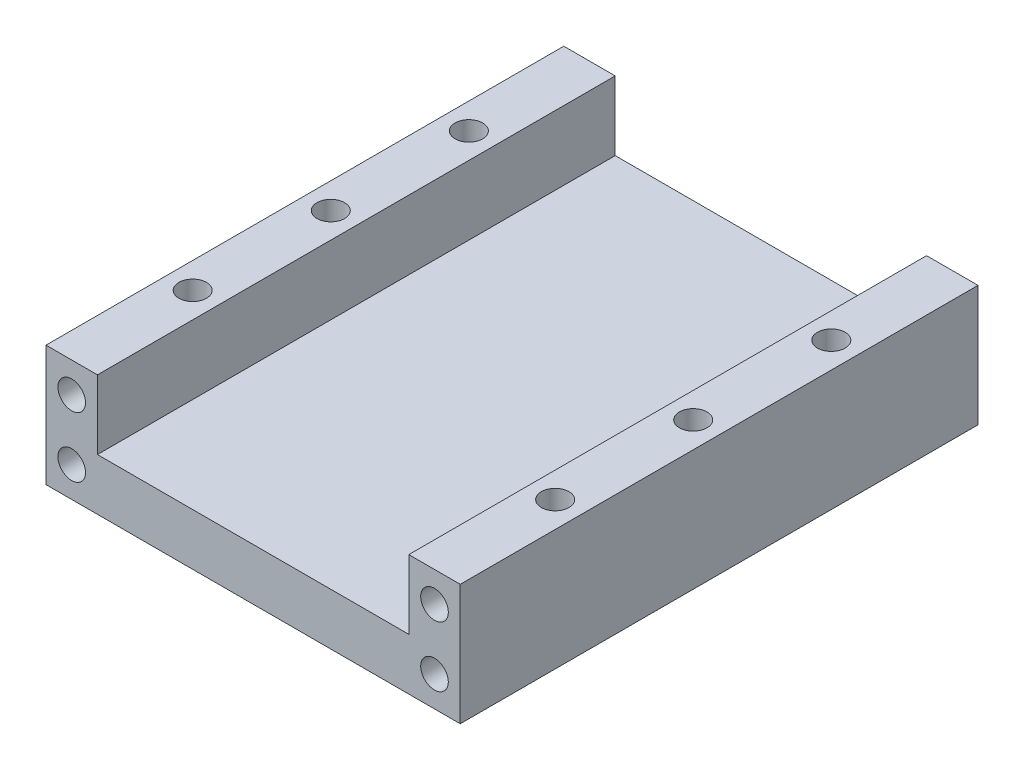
ISO-10303-21;
HEADER;
FILE_DESCRIPTION(('STEP AP214'),'2;1');
FILE_NAME('part.step','',(''),(''),'','','');
FILE_SCHEMA(('AUTOMOTIVE_DESIGN { 1 0 10303 214 1 1 1 1 }'));
ENDSEC;
DATA;
#1=APPLICATION_CONTEXT('core data for automotive mechanical design processes');
#2=APPLICATION_PROTOCOL_DEFINITION('international standard','automotive_design',2000,#1);
#3=PRODUCT_CONTEXT('',#1,'mechanical');
#4=PRODUCT('Part','Part','',(#3));
#5=PRODUCT_RELATED_PRODUCT_CATEGORY('part','',(#4));
#6=PRODUCT_DEFINITION_FORMATION('','',#4);
#7=PRODUCT_DEFINITION_CONTEXT('part definition',#1,'design');
#8=PRODUCT_DEFINITION('design','',#6,#7);
#9=PRODUCT_DEFINITION_SHAPE('','',#8);
#10=(LENGTH_UNIT() NAMED_UNIT(*) SI_UNIT(.MILLI.,.METRE.));
#11=(NAMED_UNIT(*) PLANE_ANGLE_UNIT() SI_UNIT($,.RADIAN.));
#12=(NAMED_UNIT(*) SI_UNIT($,.STERADIAN.) SOLID_ANGLE_UNIT());
#13=UNCERTAINTY_MEASURE_WITH_UNIT(LENGTH_MEASURE(1.E-05),#10,'distance_accuracy_value','');
#14=(GEOMETRIC_REPRESENTATION_CONTEXT(3) GLOBAL_UNCERTAINTY_ASSIGNED_CONTEXT((#13)) GLOBAL_UNIT_ASSIGNED_CONTEXT((#10,
#11,#12)) REPRESENTATION_CONTEXT('',''));
#15=CARTESIAN_POINT('',(0.,0.,0.));
#16=DIRECTION('',(0.,0.,1.));
#17=DIRECTION('',(1.,0.,0.));
#18=AXIS2_PLACEMENT_3D('',#15,#16,#17);
#19=CARTESIAN_POINT('',(60.,14.0579710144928,150.));
#20=DIRECTION('',(-1.,0.,0.));
#21=DIRECTION('',(0.,-1.,0.));
#22=AXIS2_PLACEMENT_3D('',#19,#20,#21);
#23=PLANE('',#22);
#24=DIRECTION('',(0.,1.,0.));
#25=VECTOR('',#24,1.);
#26=CARTESIAN_POINT('',(60.,14.0579710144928,0.));
#27=LINE('',#26,#25);
#28=CARTESIAN_POINT('',(60.,0.,0.));
#29=VERTEX_POINT('',#28);
#30=CARTESIAN_POINT('',(60.,35.,0.));
#31=VERTEX_POINT('',#30);
#32=EDGE_CURVE('E245',#29,#31,#27,.T.);
#33=ORIENTED_EDGE('',*,*,#32,.T.);
#34=DIRECTION('',(0.,0.,-1.));
#35=VECTOR('',#34,1.);
#36=CARTESIAN_POINT('',(60.,35.,150.));
#37=LINE('',#36,#35);
#38=CARTESIAN_POINT('',(60.,35.,150.));
#39=VERTEX_POINT('',#38);
#40=EDGE_CURVE('E280',#39,#31,#37,.T.);
#41=ORIENTED_EDGE('',*,*,#40,.F.);
#42=DIRECTION('',(0.,1.,0.));
#43=VECTOR('',#42,1.);
#44=CARTESIAN_POINT('',(60.,0.,150.));
#45=LINE('',#44,#43);
#46=CARTESIAN_POINT('',(60.,0.,150.));
#47=VERTEX_POINT('',#46);
#48=EDGE_CURVE('E246',#47,#39,#45,.T.);
#49=ORIENTED_EDGE('',*,*,#48,.F.);
#50=DIRECTION('',(0.,0.,-1.));
#51=VECTOR('',#50,1.);
#52=CARTESIAN_POINT('',(60.,0.,150.));
#53=LINE('',#52,#51);
#54=EDGE_CURVE('E260',#47,#29,#53,.T.);
#55=ORIENTED_EDGE('',*,*,#54,.T.);
#56=EDGE_LOOP('',(#33,#41,#49,#55));
#57=FACE_BOUND('',#56,.T.);
#58=ADVANCED_FACE('F34',(#57),#23,.F.);
#59=CARTESIAN_POINT('',(60.,35.,150.));
#60=DIRECTION('',(0.,-1.,0.));
#61=DIRECTION('',(0.,0.,-1.));
#62=AXIS2_PLACEMENT_3D('',#59,#60,#61);
#63=PLANE('',#62);
#64=CARTESIAN_POINT('',(52.5,35.,115.));
#65=DIRECTION('',(0.,1.,0.));
#66=DIRECTION('',(0.,0.,1.));
#67=AXIS2_PLACEMENT_3D('',#64,#65,#66);
#68=CIRCLE('',#67,3.99999999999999);
#69=CARTESIAN_POINT('',(52.5,35.,119.));
#70=VERTEX_POINT('',#69);
#71=EDGE_CURVE('E227',#70,#70,#68,.T.);
#72=ORIENTED_EDGE('',*,*,#71,.F.);
#73=EDGE_LOOP('',(#72));
#74=FACE_BOUND('',#73,.T.);
#75=CARTESIAN_POINT('',(52.5,35.,75.));
#76=DIRECTION('',(0.,1.,0.));
#77=DIRECTION('',(0.,0.,1.));
#78=AXIS2_PLACEMENT_3D('',#75,#76,#77);
#79=CIRCLE('',#78,3.99999999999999);
#80=CARTESIAN_POINT('',(52.5,35.,79.));
#81=VERTEX_POINT('',#80);
#82=EDGE_CURVE('E233',#81,#81,#79,.T.);
#83=ORIENTED_EDGE('',*,*,#82,.F.);
#84=EDGE_LOOP('',(#83));
#85=FACE_BOUND('',#84,.T.);
#86=CARTESIAN_POINT('',(52.5,35.,35.));
#87=DIRECTION('',(0.,1.,0.));
#88=DIRECTION('',(0.,0.,1.));
#89=AXIS2_PLACEMENT_3D('',#86,#87,#88);
#90=CIRCLE('',#89,3.99999999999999);
#91=CARTESIAN_POINT('',(52.5,35.,39.));
#92=VERTEX_POINT('',#91);
#93=EDGE_CURVE('E239',#92,#92,#90,.T.);
#94=ORIENTED_EDGE('',*,*,#93,.F.);
#95=EDGE_LOOP('',(#94));
#96=FACE_BOUND('',#95,.T.);
#97=DIRECTION('',(-1.,0.,0.));
#98=VECTOR('',#97,1.);
#99=CARTESIAN_POINT('',(60.,35.,0.));
#100=LINE('',#99,#98);
#101=CARTESIAN_POINT('',(45.1,35.,0.));
#102=VERTEX_POINT('',#101);
#103=EDGE_CURVE('E262',#31,#102,#100,.T.);
#104=ORIENTED_EDGE('',*,*,#103,.T.);
#105=DIRECTION('',(0.,0.,1.));
#106=VECTOR('',#105,1.);
#107=CARTESIAN_POINT('',(45.1,35.,-14.));
#108=LINE('',#107,#106);
#109=CARTESIAN_POINT('',(45.1,35.,150.));
#110=VERTEX_POINT('',#109);
#111=EDGE_CURVE('E204',#102,#110,#108,.T.);
#112=ORIENTED_EDGE('',*,*,#111,.T.);
#113=DIRECTION('',(-1.,0.,0.));
#114=VECTOR('',#113,1.);
#115=CARTESIAN_POINT('',(60.,35.,150.));
#116=LINE('',#115,#114);
#117=EDGE_CURVE('E248',#39,#110,#116,.T.);
#118=ORIENTED_EDGE('',*,*,#117,.F.);
#119=ORIENTED_EDGE('',*,*,#40,.T.);
#120=EDGE_LOOP('',(#104,#112,#118,#119));
#121=FACE_BOUND('',#120,.T.);
#122=ADVANCED_FACE('F287',(#74,#85,#96,#121),#63,.F.);
#123=CARTESIAN_POINT('',(45.,15.,150.));
#124=DIRECTION('',(0.,-1.,0.));
#125=DIRECTION('',(1.,0.,0.));
#126=AXIS2_PLACEMENT_3D('',#123,#124,#125);
#127=PLANE('',#126);
#128=DIRECTION('',(-1.,0.,0.));
#129=VECTOR('',#128,1.);
#130=CARTESIAN_POINT('',(45.,15.,0.));
#131=LINE('',#130,#129);
#132=CARTESIAN_POINT('',(45.1,15.,0.));
#133=VERTEX_POINT('',#132);
#134=CARTESIAN_POINT('',(-45.1,15.,0.));
#135=VERTEX_POINT('',#134);
#136=EDGE_CURVE('E48',#133,#135,#131,.T.);
#137=ORIENTED_EDGE('',*,*,#136,.T.);
#138=DIRECTION('',(0.,0.,1.));
#139=VECTOR('',#138,1.);
#140=CARTESIAN_POINT('',(-45.1,15.,-14.));
#141=LINE('',#140,#139);
#142=CARTESIAN_POINT('',(-45.1,15.,150.));
#143=VERTEX_POINT('',#142);
#144=EDGE_CURVE('E198',#135,#143,#141,.T.);
#145=ORIENTED_EDGE('',*,*,#144,.T.);
#146=DIRECTION('',(-1.,0.,0.));
#147=VECTOR('',#146,1.);
#148=CARTESIAN_POINT('',(45.,15.,150.));
#149=LINE('',#148,#147);
#150=CARTESIAN_POINT('',(45.1,15.,150.));
#151=VERTEX_POINT('',#150);
#152=EDGE_CURVE('E252',#151,#143,#149,.T.);
#153=ORIENTED_EDGE('',*,*,#152,.F.);
#154=DIRECTION('',(0.,0.,1.));
#155=VECTOR('',#154,1.);
#156=CARTESIAN_POINT('',(45.1,15.,-14.));
#157=LINE('',#156,#155);
#158=EDGE_CURVE('E203',#133,#151,#157,.T.);
#159=ORIENTED_EDGE('',*,*,#158,.F.);
#160=EDGE_LOOP('',(#137,#145,#153,#159));
#161=FACE_BOUND('',#160,.T.);
#162=ADVANCED_FACE('F314',(#161),#127,.F.);
#163=CARTESIAN_POINT('',(-60.,35.,150.));
#164=DIRECTION('',(0.,-1.,0.));
#165=DIRECTION('',(0.,0.,-1.));
#166=AXIS2_PLACEMENT_3D('',#163,#164,#165);
#167=PLANE('',#166);
#168=CARTESIAN_POINT('',(-52.5,35.,35.));
#169=DIRECTION('',(0.,1.,0.));
#170=DIRECTION('',(0.,0.,1.));
#171=AXIS2_PLACEMENT_3D('',#168,#169,#170);
#172=CIRCLE('',#171,3.99999999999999);
#173=CARTESIAN_POINT('',(-52.5,35.,39.));
#174=VERTEX_POINT('',#173);
#175=EDGE_CURVE('E207',#174,#174,#172,.T.);
#176=ORIENTED_EDGE('',*,*,#175,.F.);
#177=EDGE_LOOP('',(#176));
#178=FACE_BOUND('',#177,.T.);
#179=CARTESIAN_POINT('',(-52.5,35.,75.));
#180=DIRECTION('',(0.,1.,0.));
#181=DIRECTION('',(0.,0.,1.));
#182=AXIS2_PLACEMENT_3D('',#179,#180,#181);
#183=CIRCLE('',#182,3.99999999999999);
#184=CARTESIAN_POINT('',(-52.5,35.,79.));
#185=VERTEX_POINT('',#184);
#186=EDGE_CURVE('E215',#185,#185,#183,.T.);
#187=ORIENTED_EDGE('',*,*,#186,.F.);
#188=EDGE_LOOP('',(#187));
#189=FACE_BOUND('',#188,.T.);
#190=CARTESIAN_POINT('',(-52.5,35.,115.));
#191=DIRECTION('',(0.,1.,0.));
#192=DIRECTION('',(0.,0.,1.));
#193=AXIS2_PLACEMENT_3D('',#190,#191,#192);
#194=CIRCLE('',#193,3.99999999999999);
#195=CARTESIAN_POINT('',(-52.5,35.,119.));
#196=VERTEX_POINT('',#195);
#197=EDGE_CURVE('E221',#196,#196,#194,.T.);
#198=ORIENTED_EDGE('',*,*,#197,.F.);
#199=EDGE_LOOP('',(#198));
#200=FACE_BOUND('',#199,.T.);
#201=DIRECTION('',(-1.,0.,0.));
#202=VECTOR('',#201,1.);
#203=CARTESIAN_POINT('',(-60.,35.,150.));
#204=LINE('',#203,#202);
#205=CARTESIAN_POINT('',(-45.1,35.,150.));
#206=VERTEX_POINT('',#205);
#207=CARTESIAN_POINT('',(-60.,35.,150.));
#208=VERTEX_POINT('',#207);
#209=EDGE_CURVE('E254',#206,#208,#204,.T.);
#210=ORIENTED_EDGE('',*,*,#209,.F.);
#211=DIRECTION('',(0.,0.,1.));
#212=VECTOR('',#211,1.);
#213=CARTESIAN_POINT('',(-45.1,35.,-14.));
#214=LINE('',#213,#212);
#215=CARTESIAN_POINT('',(-45.1,35.,0.));
#216=VERTEX_POINT('',#215);
#217=EDGE_CURVE('E197',#216,#206,#214,.T.);
#218=ORIENTED_EDGE('',*,*,#217,.F.);
#219=DIRECTION('',(-1.,0.,0.));
#220=VECTOR('',#219,1.);
#221=CARTESIAN_POINT('',(-60.,35.,0.));
#222=LINE('',#221,#220);
#223=CARTESIAN_POINT('',(-60.,35.,0.));
#224=VERTEX_POINT('',#223);
#225=EDGE_CURVE('E266',#216,#224,#222,.T.);
#226=ORIENTED_EDGE('',*,*,#225,.T.);
#227=DIRECTION('',(0.,0.,-1.));
#228=VECTOR('',#227,1.);
#229=CARTESIAN_POINT('',(-60.,35.,150.));
#230=LINE('',#229,#228);
#231=EDGE_CURVE('E277',#208,#224,#230,.T.);
#232=ORIENTED_EDGE('',*,*,#231,.F.);
#233=EDGE_LOOP('',(#210,#218,#226,#232));
#234=FACE_BOUND('',#233,.T.);
#235=ADVANCED_FACE('F307',(#178,#189,#200,#234),#167,.F.);
#236=CARTESIAN_POINT('',(-60.,0.,150.));
#237=DIRECTION('',(1.,0.,0.));
#238=DIRECTION('',(0.,1.,0.));
#239=AXIS2_PLACEMENT_3D('',#236,#237,#238);
#240=PLANE('',#239);
#241=DIRECTION('',(0.,-1.,0.));
#242=VECTOR('',#241,1.);
#243=CARTESIAN_POINT('',(-60.,0.,0.));
#244=LINE('',#243,#242);
#245=CARTESIAN_POINT('',(-60.,0.,0.));
#246=VERTEX_POINT('',#245);
#247=EDGE_CURVE('E268',#224,#246,#244,.T.);
#248=ORIENTED_EDGE('',*,*,#247,.T.);
#249=DIRECTION('',(0.,0.,-1.));
#250=VECTOR('',#249,1.);
#251=CARTESIAN_POINT('',(-60.,0.,150.));
#252=LINE('',#251,#250);
#253=CARTESIAN_POINT('',(-60.,0.,150.));
#254=VERTEX_POINT('',#253);
#255=EDGE_CURVE('E274',#254,#246,#252,.T.);
#256=ORIENTED_EDGE('',*,*,#255,.F.);
#257=DIRECTION('',(0.,-1.,0.));
#258=VECTOR('',#257,1.);
#259=CARTESIAN_POINT('',(-60.,14.0579710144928,150.));
#260=LINE('',#259,#258);
#261=EDGE_CURVE('E256',#208,#254,#260,.T.);
#262=ORIENTED_EDGE('',*,*,#261,.F.);
#263=ORIENTED_EDGE('',*,*,#231,.T.);
#264=EDGE_LOOP('',(#248,#256,#262,#263));
#265=FACE_BOUND('',#264,.T.);
#266=ADVANCED_FACE('F301',(#265),#240,.F.);
#267=CARTESIAN_POINT('',(-60.,0.,150.));
#268=DIRECTION('',(0.,1.,0.));
#269=DIRECTION('',(0.,0.,1.));
#270=AXIS2_PLACEMENT_3D('',#267,#268,#269);
#271=PLANE('',#270);
#272=CARTESIAN_POINT('',(-52.55,0.,15.));
#273=DIRECTION('',(0.,-1.,0.));
#274=DIRECTION('',(0.,0.,-1.));
#275=AXIS2_PLACEMENT_3D('',#272,#273,#274);
#276=CIRCLE('',#275,3.99999999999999);
#277=CARTESIAN_POINT('',(-52.55,0.,11.));
#278=VERTEX_POINT('',#277);
#279=EDGE_CURVE('E148',#278,#278,#276,.T.);
#280=ORIENTED_EDGE('',*,*,#279,.F.);
#281=EDGE_LOOP('',(#280));
#282=FACE_BOUND('',#281,.T.);
#283=CARTESIAN_POINT('',(-52.55,0.,125.));
#284=DIRECTION('',(0.,-1.,0.));
#285=DIRECTION('',(0.,0.,-1.));
#286=AXIS2_PLACEMENT_3D('',#283,#284,#285);
#287=CIRCLE('',#286,3.99999999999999);
#288=CARTESIAN_POINT('',(-52.55,0.,121.));
#289=VERTEX_POINT('',#288);
#290=EDGE_CURVE('E147',#289,#289,#287,.T.);
#291=ORIENTED_EDGE('',*,*,#290,.F.);
#292=EDGE_LOOP('',(#291));
#293=FACE_BOUND('',#292,.T.);
#294=CARTESIAN_POINT('',(52.55,0.,15.));
#295=DIRECTION('',(0.,-1.,0.));
#296=DIRECTION('',(0.,0.,-1.));
#297=AXIS2_PLACEMENT_3D('',#294,#295,#296);
#298=CIRCLE('',#297,3.99999999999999);
#299=CARTESIAN_POINT('',(52.55,0.,11.));
#300=VERTEX_POINT('',#299);
#301=EDGE_CURVE('E158',#300,#300,#298,.T.);
#302=ORIENTED_EDGE('',*,*,#301,.F.);
#303=EDGE_LOOP('',(#302));
#304=FACE_BOUND('',#303,.T.);
#305=CARTESIAN_POINT('',(52.55,0.,125.));
#306=DIRECTION('',(0.,-1.,0.));
#307=DIRECTION('',(0.,0.,-1.));
#308=AXIS2_PLACEMENT_3D('',#305,#306,#307);
#309=CIRCLE('',#308,3.99999999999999);
#310=CARTESIAN_POINT('',(52.55,0.,121.));
#311=VERTEX_POINT('',#310);
#312=EDGE_CURVE('E164',#311,#311,#309,.T.);
#313=ORIENTED_EDGE('',*,*,#312,.F.);
#314=EDGE_LOOP('',(#313));
#315=FACE_BOUND('',#314,.T.);
#316=DIRECTION('',(1.,0.,0.));
#317=VECTOR('',#316,1.);
#318=CARTESIAN_POINT('',(-60.,0.,0.));
#319=LINE('',#318,#317);
#320=EDGE_CURVE('E249',#246,#29,#319,.T.);
#321=ORIENTED_EDGE('',*,*,#320,.T.);
#322=ORIENTED_EDGE('',*,*,#54,.F.);
#323=DIRECTION('',(1.,0.,0.));
#324=VECTOR('',#323,1.);
#325=CARTESIAN_POINT('',(-60.,0.,150.));
#326=LINE('',#325,#324);
#327=EDGE_CURVE('E258',#254,#47,#326,.T.);
#328=ORIENTED_EDGE('',*,*,#327,.F.);
#329=ORIENTED_EDGE('',*,*,#255,.T.);
#330=EDGE_LOOP('',(#321,#322,#328,#329));
#331=FACE_BOUND('',#330,.T.);
#332=ADVANCED_FACE('F296',(#282,#293,#304,#315,#331),#271,.F.);
#333=CARTESIAN_POINT('',(0.,0.,150.));
#334=DIRECTION('',(0.,0.,1.));
#335=DIRECTION('',(1.,0.,0.));
#336=AXIS2_PLACEMENT_3D('',#333,#334,#335);
#337=PLANE('',#336);
#338=CARTESIAN_POINT('',(-52.55,26.25,150.));
#339=DIRECTION('',(0.,0.,1.));
#340=DIRECTION('',(1.,0.,0.));
#341=AXIS2_PLACEMENT_3D('',#338,#339,#340);
#342=CIRCLE('',#341,4.);
#343=CARTESIAN_POINT('',(-48.55,26.25,150.));
#344=VERTEX_POINT('',#343);
#345=EDGE_CURVE('E170',#344,#344,#342,.T.);
#346=ORIENTED_EDGE('',*,*,#345,.F.);
#347=EDGE_LOOP('',(#346));
#348=FACE_BOUND('',#347,.T.);
#349=CARTESIAN_POINT('',(-52.55,8.75000000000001,150.));
#350=DIRECTION('',(0.,0.,1.));
#351=DIRECTION('',(1.,0.,0.));
#352=AXIS2_PLACEMENT_3D('',#349,#350,#351);
#353=CIRCLE('',#352,4.);
#354=CARTESIAN_POINT('',(-48.55,8.75000000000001,150.));
#355=VERTEX_POINT('',#354);
#356=EDGE_CURVE('E176',#355,#355,#353,.T.);
#357=ORIENTED_EDGE('',*,*,#356,.F.);
#358=EDGE_LOOP('',(#357));
#359=FACE_BOUND('',#358,.T.);
#360=CARTESIAN_POINT('',(52.55,8.75000000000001,150.));
#361=DIRECTION('',(0.,0.,1.));
#362=DIRECTION('',(1.,0.,0.));
#363=AXIS2_PLACEMENT_3D('',#360,#361,#362);
#364=CIRCLE('',#363,4.);
#365=CARTESIAN_POINT('',(56.55,8.75000000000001,150.));
#366=VERTEX_POINT('',#365);
#367=EDGE_CURVE('E182',#366,#366,#364,.T.);
#368=ORIENTED_EDGE('',*,*,#367,.F.);
#369=EDGE_LOOP('',(#368));
#370=FACE_BOUND('',#369,.T.);
#371=CARTESIAN_POINT('',(52.55,26.25,150.));
#372=DIRECTION('',(0.,0.,1.));
#373=DIRECTION('',(1.,0.,0.));
#374=AXIS2_PLACEMENT_3D('',#371,#372,#373);
#375=CIRCLE('',#374,4.);
#376=CARTESIAN_POINT('',(56.55,26.25,150.));
#377=VERTEX_POINT('',#376);
#378=EDGE_CURVE('E188',#377,#377,#375,.T.);
#379=ORIENTED_EDGE('',*,*,#378,.F.);
#380=EDGE_LOOP('',(#379));
#381=FACE_BOUND('',#380,.T.);
#382=ORIENTED_EDGE('',*,*,#152,.T.);
#383=DIRECTION('',(0.,-1.,0.));
#384=VECTOR('',#383,1.);
#385=CARTESIAN_POINT('',(-45.1,15.,150.));
#386=LINE('',#385,#384);
#387=EDGE_CURVE('E194',#206,#143,#386,.T.);
#388=ORIENTED_EDGE('',*,*,#387,.F.);
#389=ORIENTED_EDGE('',*,*,#209,.T.);
#390=ORIENTED_EDGE('',*,*,#261,.T.);
#391=ORIENTED_EDGE('',*,*,#327,.T.);
#392=ORIENTED_EDGE('',*,*,#48,.T.);
#393=ORIENTED_EDGE('',*,*,#117,.T.);
#394=DIRECTION('',(0.,1.,0.));
#395=VECTOR('',#394,1.);
#396=CARTESIAN_POINT('',(45.1,15.,150.));
#397=LINE('',#396,#395);
#398=EDGE_CURVE('E200',#151,#110,#397,.T.);
#399=ORIENTED_EDGE('',*,*,#398,.F.);
#400=EDGE_LOOP('',(#382,#388,#389,#390,#391,#392,#393,#399));
#401=FACE_BOUND('',#400,.T.);
#402=ADVANCED_FACE('F312',(#348,#359,#370,#381,#401),#337,.T.);
#403=CARTESIAN_POINT('',(0.,0.,0.));
#404=DIRECTION('',(0.,0.,1.));
#405=DIRECTION('',(1.,0.,0.));
#406=AXIS2_PLACEMENT_3D('',#403,#404,#405);
#407=PLANE('',#406);
#408=DIRECTION('',(0.,-1.,0.));
#409=VECTOR('',#408,1.);
#410=CARTESIAN_POINT('',(-45.1,0.,0.));
#411=LINE('',#410,#409);
#412=EDGE_CURVE('E11',#216,#135,#411,.T.);
#413=ORIENTED_EDGE('',*,*,#412,.T.);
#414=ORIENTED_EDGE('',*,*,#136,.F.);
#415=DIRECTION('',(0.,1.,0.));
#416=VECTOR('',#415,1.);
#417=CARTESIAN_POINT('',(45.1,0.,0.));
#418=LINE('',#417,#416);
#419=EDGE_CURVE('E41',#133,#102,#418,.T.);
#420=ORIENTED_EDGE('',*,*,#419,.T.);
#421=ORIENTED_EDGE('',*,*,#103,.F.);
#422=ORIENTED_EDGE('',*,*,#32,.F.);
#423=ORIENTED_EDGE('',*,*,#320,.F.);
#424=ORIENTED_EDGE('',*,*,#247,.F.);
#425=ORIENTED_EDGE('',*,*,#225,.F.);
#426=EDGE_LOOP('',(#413,#414,#420,#421,#422,#423,#424,#425));
#427=FACE_BOUND('',#426,.T.);
#428=ADVANCED_FACE('F284',(#427),#407,.F.);
#429=CARTESIAN_POINT('',(52.5,20.,35.));
#430=DIRECTION('',(0.,1.,0.));
#431=DIRECTION('',(0.,0.,1.));
#432=AXIS2_PLACEMENT_3D('',#429,#430,#431);
#433=CONICAL_SURFACE('',#432,3.99999999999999,1.02974425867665);
#434=CARTESIAN_POINT('',(52.5,17.5965575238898,35.));
#435=VERTEX_POINT('',#434);
#436=VERTEX_LOOP('',#435);
#437=FACE_BOUND('',#436,.T.);
#438=CARTESIAN_POINT('',(52.5,20.,35.));
#439=DIRECTION('',(0.,1.,0.));
#440=DIRECTION('',(0.,0.,1.));
#441=AXIS2_PLACEMENT_3D('',#438,#439,#440);
#442=CIRCLE('',#441,3.99999999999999);
#443=CARTESIAN_POINT('',(52.5,20.,39.));
#444=VERTEX_POINT('',#443);
#445=EDGE_CURVE('E242',#444,#444,#442,.T.);
#446=ORIENTED_EDGE('',*,*,#445,.T.);
#447=EDGE_LOOP('',(#446));
#448=FACE_BOUND('',#447,.T.);
#449=ADVANCED_FACE('F380',(#437,#448),#433,.F.);
#450=CARTESIAN_POINT('',(52.5,35.,35.));
#451=DIRECTION('',(0.,1.,0.));
#452=DIRECTION('',(0.,0.,1.));
#453=AXIS2_PLACEMENT_3D('',#450,#451,#452);
#454=CYLINDRICAL_SURFACE('',#453,3.99999999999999);
#455=ORIENTED_EDGE('',*,*,#445,.F.);
#456=EDGE_LOOP('',(#455));
#457=FACE_BOUND('',#456,.T.);
#458=ORIENTED_EDGE('',*,*,#93,.T.);
#459=EDGE_LOOP('',(#458));
#460=FACE_BOUND('',#459,.T.);
#461=ADVANCED_FACE('F389',(#457,#460),#454,.F.);
#462=CARTESIAN_POINT('',(52.5,20.,75.));
#463=DIRECTION('',(0.,1.,0.));
#464=DIRECTION('',(0.,0.,1.));
#465=AXIS2_PLACEMENT_3D('',#462,#463,#464);
#466=CONICAL_SURFACE('',#465,3.99999999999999,1.02974425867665);
#467=CARTESIAN_POINT('',(52.5,17.5965575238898,75.));
#468=VERTEX_POINT('',#467);
#469=VERTEX_LOOP('',#468);
#470=FACE_BOUND('',#469,.T.);
#471=CARTESIAN_POINT('',(52.5,20.,75.));
#472=DIRECTION('',(0.,1.,0.));
#473=DIRECTION('',(0.,0.,1.));
#474=AXIS2_PLACEMENT_3D('',#471,#472,#473);
#475=CIRCLE('',#474,3.99999999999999);
#476=CARTESIAN_POINT('',(52.5,20.,79.));
#477=VERTEX_POINT('',#476);
#478=EDGE_CURVE('E236',#477,#477,#475,.T.);
#479=ORIENTED_EDGE('',*,*,#478,.T.);
#480=EDGE_LOOP('',(#479));
#481=FACE_BOUND('',#480,.T.);
#482=ADVANCED_FACE('F396',(#470,#481),#466,.F.);
#483=CARTESIAN_POINT('',(52.5,35.,75.));
#484=DIRECTION('',(0.,1.,0.));
#485=DIRECTION('',(0.,0.,1.));
#486=AXIS2_PLACEMENT_3D('',#483,#484,#485);
#487=CYLINDRICAL_SURFACE('',#486,3.99999999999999);
#488=ORIENTED_EDGE('',*,*,#478,.F.);
#489=EDGE_LOOP('',(#488));
#490=FACE_BOUND('',#489,.T.);
#491=ORIENTED_EDGE('',*,*,#82,.T.);
#492=EDGE_LOOP('',(#491));
#493=FACE_BOUND('',#492,.T.);
#494=ADVANCED_FACE('F404',(#490,#493),#487,.F.);
#495=CARTESIAN_POINT('',(52.5,20.,115.));
#496=DIRECTION('',(0.,1.,0.));
#497=DIRECTION('',(0.,0.,1.));
#498=AXIS2_PLACEMENT_3D('',#495,#496,#497);
#499=CONICAL_SURFACE('',#498,3.99999999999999,1.02974425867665);
#500=CARTESIAN_POINT('',(52.5,17.5965575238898,115.));
#501=VERTEX_POINT('',#500);
#502=VERTEX_LOOP('',#501);
#503=FACE_BOUND('',#502,.T.);
#504=CARTESIAN_POINT('',(52.5,20.,115.));
#505=DIRECTION('',(0.,1.,0.));
#506=DIRECTION('',(0.,0.,1.));
#507=AXIS2_PLACEMENT_3D('',#504,#505,#506);
#508=CIRCLE('',#507,3.99999999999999);
#509=CARTESIAN_POINT('',(52.5,20.,119.));
#510=VERTEX_POINT('',#509);
#511=EDGE_CURVE('E230',#510,#510,#508,.T.);
#512=ORIENTED_EDGE('',*,*,#511,.T.);
#513=EDGE_LOOP('',(#512));
#514=FACE_BOUND('',#513,.T.);
#515=ADVANCED_FACE('F412',(#503,#514),#499,.F.);
#516=CARTESIAN_POINT('',(52.5,35.,115.));
#517=DIRECTION('',(0.,1.,0.));
#518=DIRECTION('',(0.,0.,1.));
#519=AXIS2_PLACEMENT_3D('',#516,#517,#518);
#520=CYLINDRICAL_SURFACE('',#519,3.99999999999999);
#521=ORIENTED_EDGE('',*,*,#511,.F.);
#522=EDGE_LOOP('',(#521));
#523=FACE_BOUND('',#522,.T.);
#524=ORIENTED_EDGE('',*,*,#71,.T.);
#525=EDGE_LOOP('',(#524));
#526=FACE_BOUND('',#525,.T.);
#527=ADVANCED_FACE('F420',(#523,#526),#520,.F.);
#528=CARTESIAN_POINT('',(-52.5,20.,115.));
#529=DIRECTION('',(0.,1.,0.));
#530=DIRECTION('',(0.,0.,1.));
#531=AXIS2_PLACEMENT_3D('',#528,#529,#530);
#532=CONICAL_SURFACE('',#531,3.99999999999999,1.02974425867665);
#533=CARTESIAN_POINT('',(-52.5,17.5965575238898,115.));
#534=VERTEX_POINT('',#533);
#535=VERTEX_LOOP('',#534);
#536=FACE_BOUND('',#535,.T.);
#537=CARTESIAN_POINT('',(-52.5,20.,115.));
#538=DIRECTION('',(0.,1.,0.));
#539=DIRECTION('',(0.,0.,1.));
#540=AXIS2_PLACEMENT_3D('',#537,#538,#539);
#541=CIRCLE('',#540,3.99999999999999);
#542=CARTESIAN_POINT('',(-52.5,20.,119.));
#543=VERTEX_POINT('',#542);
#544=EDGE_CURVE('E224',#543,#543,#541,.T.);
#545=ORIENTED_EDGE('',*,*,#544,.T.);
#546=EDGE_LOOP('',(#545));
#547=FACE_BOUND('',#546,.T.);
#548=ADVANCED_FACE('F428',(#536,#547),#532,.F.);
#549=CARTESIAN_POINT('',(-52.5,35.,115.));
#550=DIRECTION('',(0.,1.,0.));
#551=DIRECTION('',(0.,0.,1.));
#552=AXIS2_PLACEMENT_3D('',#549,#550,#551);
#553=CYLINDRICAL_SURFACE('',#552,3.99999999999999);
#554=ORIENTED_EDGE('',*,*,#544,.F.);
#555=EDGE_LOOP('',(#554));
#556=FACE_BOUND('',#555,.T.);
#557=ORIENTED_EDGE('',*,*,#197,.T.);
#558=EDGE_LOOP('',(#557));
#559=FACE_BOUND('',#558,.T.);
#560=ADVANCED_FACE('F436',(#556,#559),#553,.F.);
#561=CARTESIAN_POINT('',(-52.5,20.,75.));
#562=DIRECTION('',(0.,1.,0.));
#563=DIRECTION('',(0.,0.,1.));
#564=AXIS2_PLACEMENT_3D('',#561,#562,#563);
#565=CONICAL_SURFACE('',#564,3.99999999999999,1.02974425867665);
#566=CARTESIAN_POINT('',(-52.5,17.5965575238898,75.));
#567=VERTEX_POINT('',#566);
#568=VERTEX_LOOP('',#567);
#569=FACE_BOUND('',#568,.T.);
#570=CARTESIAN_POINT('',(-52.5,20.,75.));
#571=DIRECTION('',(0.,1.,0.));
#572=DIRECTION('',(0.,0.,1.));
#573=AXIS2_PLACEMENT_3D('',#570,#571,#572);
#574=CIRCLE('',#573,3.99999999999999);
#575=CARTESIAN_POINT('',(-52.5,20.,79.));
#576=VERTEX_POINT('',#575);
#577=EDGE_CURVE('E218',#576,#576,#574,.T.);
#578=ORIENTED_EDGE('',*,*,#577,.T.);
#579=EDGE_LOOP('',(#578));
#580=FACE_BOUND('',#579,.T.);
#581=ADVANCED_FACE('F444',(#569,#580),#565,.F.);
#582=CARTESIAN_POINT('',(-52.5,35.,75.));
#583=DIRECTION('',(0.,1.,0.));
#584=DIRECTION('',(0.,0.,1.));
#585=AXIS2_PLACEMENT_3D('',#582,#583,#584);
#586=CYLINDRICAL_SURFACE('',#585,3.99999999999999);
#587=ORIENTED_EDGE('',*,*,#577,.F.);
#588=EDGE_LOOP('',(#587));
#589=FACE_BOUND('',#588,.T.);
#590=ORIENTED_EDGE('',*,*,#186,.T.);
#591=EDGE_LOOP('',(#590));
#592=FACE_BOUND('',#591,.T.);
#593=ADVANCED_FACE('F452',(#589,#592),#586,.F.);
#594=CARTESIAN_POINT('',(-52.5,20.,35.));
#595=DIRECTION('',(0.,1.,0.));
#596=DIRECTION('',(0.,0.,1.));
#597=AXIS2_PLACEMENT_3D('',#594,#595,#596);
#598=CONICAL_SURFACE('',#597,3.99999999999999,1.02974425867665);
#599=CARTESIAN_POINT('',(-52.5,17.5965575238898,35.));
#600=VERTEX_POINT('',#599);
#601=VERTEX_LOOP('',#600);
#602=FACE_BOUND('',#601,.T.);
#603=CARTESIAN_POINT('',(-52.5,20.,35.));
#604=DIRECTION('',(0.,1.,0.));
#605=DIRECTION('',(0.,0.,1.));
#606=AXIS2_PLACEMENT_3D('',#603,#604,#605);
#607=CIRCLE('',#606,3.99999999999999);
#608=CARTESIAN_POINT('',(-52.5,20.,39.));
#609=VERTEX_POINT('',#608);
#610=EDGE_CURVE('E212',#609,#609,#607,.T.);
#611=ORIENTED_EDGE('',*,*,#610,.T.);
#612=EDGE_LOOP('',(#611));
#613=FACE_BOUND('',#612,.T.);
#614=ADVANCED_FACE('F460',(#602,#613),#598,.F.);
#615=CARTESIAN_POINT('',(-52.5,35.,35.));
#616=DIRECTION('',(0.,1.,0.));
#617=DIRECTION('',(0.,0.,1.));
#618=AXIS2_PLACEMENT_3D('',#615,#616,#617);
#619=CYLINDRICAL_SURFACE('',#618,3.99999999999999);
#620=ORIENTED_EDGE('',*,*,#610,.F.);
#621=EDGE_LOOP('',(#620));
#622=FACE_BOUND('',#621,.T.);
#623=ORIENTED_EDGE('',*,*,#175,.T.);
#624=EDGE_LOOP('',(#623));
#625=FACE_BOUND('',#624,.T.);
#626=ADVANCED_FACE('F467',(#622,#625),#619,.F.);
#627=CARTESIAN_POINT('',(45.1,15.,-14.));
#628=DIRECTION('',(1.,0.,0.));
#629=DIRECTION('',(0.,0.,-1.));
#630=AXIS2_PLACEMENT_3D('',#627,#628,#629);
#631=PLANE('',#630);
#632=ORIENTED_EDGE('',*,*,#158,.T.);
#633=ORIENTED_EDGE('',*,*,#398,.T.);
#634=ORIENTED_EDGE('',*,*,#111,.F.);
#635=ORIENTED_EDGE('',*,*,#419,.F.);
#636=EDGE_LOOP('',(#632,#633,#634,#635));
#637=FACE_BOUND('',#636,.T.);
#638=ADVANCED_FACE('F473',(#637),#631,.F.);
#639=CARTESIAN_POINT('',(-45.1,15.,-14.));
#640=DIRECTION('',(-1.,0.,0.));
#641=DIRECTION('',(0.,0.,1.));
#642=AXIS2_PLACEMENT_3D('',#639,#640,#641);
#643=PLANE('',#642);
#644=ORIENTED_EDGE('',*,*,#217,.T.);
#645=ORIENTED_EDGE('',*,*,#387,.T.);
#646=ORIENTED_EDGE('',*,*,#144,.F.);
#647=ORIENTED_EDGE('',*,*,#412,.F.);
#648=EDGE_LOOP('',(#644,#645,#646,#647));
#649=FACE_BOUND('',#648,.T.);
#650=ADVANCED_FACE('F310',(#649),#643,.F.);
#651=CARTESIAN_POINT('',(52.55,26.25,135.));
#652=DIRECTION('',(0.,0.,1.));
#653=DIRECTION('',(1.,0.,0.));
#654=AXIS2_PLACEMENT_3D('',#651,#652,#653);
#655=CONICAL_SURFACE('',#654,4.,1.02974425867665);
#656=CARTESIAN_POINT('',(52.55,26.25,132.59655752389));
#657=VERTEX_POINT('',#656);
#658=VERTEX_LOOP('',#657);
#659=FACE_BOUND('',#658,.T.);
#660=CARTESIAN_POINT('',(52.55,26.25,135.));
#661=DIRECTION('',(0.,0.,1.));
#662=DIRECTION('',(1.,0.,0.));
#663=AXIS2_PLACEMENT_3D('',#660,#661,#662);
#664=CIRCLE('',#663,4.);
#665=CARTESIAN_POINT('',(56.55,26.25,135.));
#666=VERTEX_POINT('',#665);
#667=EDGE_CURVE('E191',#666,#666,#664,.T.);
#668=ORIENTED_EDGE('',*,*,#667,.T.);
#669=EDGE_LOOP('',(#668));
#670=FACE_BOUND('',#669,.T.);
#671=ADVANCED_FACE('F501',(#659,#670),#655,.F.);
#672=CARTESIAN_POINT('',(52.55,26.25,150.));
#673=DIRECTION('',(0.,0.,1.));
#674=DIRECTION('',(1.,0.,0.));
#675=AXIS2_PLACEMENT_3D('',#672,#673,#674);
#676=CYLINDRICAL_SURFACE('',#675,4.);
#677=ORIENTED_EDGE('',*,*,#667,.F.);
#678=EDGE_LOOP('',(#677));
#679=FACE_BOUND('',#678,.T.);
#680=ORIENTED_EDGE('',*,*,#378,.T.);
#681=EDGE_LOOP('',(#680));
#682=FACE_BOUND('',#681,.T.);
#683=ADVANCED_FACE('F508',(#679,#682),#676,.F.);
#684=CARTESIAN_POINT('',(52.55,8.75000000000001,135.));
#685=DIRECTION('',(0.,0.,1.));
#686=DIRECTION('',(1.,0.,0.));
#687=AXIS2_PLACEMENT_3D('',#684,#685,#686);
#688=CONICAL_SURFACE('',#687,4.,1.02974425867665);
#689=CARTESIAN_POINT('',(52.55,8.75000000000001,132.59655752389));
#690=VERTEX_POINT('',#689);
#691=VERTEX_LOOP('',#690);
#692=FACE_BOUND('',#691,.T.);
#693=CARTESIAN_POINT('',(52.55,8.75000000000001,135.));
#694=DIRECTION('',(0.,0.,1.));
#695=DIRECTION('',(1.,0.,0.));
#696=AXIS2_PLACEMENT_3D('',#693,#694,#695);
#697=CIRCLE('',#696,4.);
#698=CARTESIAN_POINT('',(56.55,8.75000000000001,135.));
#699=VERTEX_POINT('',#698);
#700=EDGE_CURVE('E185',#699,#699,#697,.T.);
#701=ORIENTED_EDGE('',*,*,#700,.T.);
#702=EDGE_LOOP('',(#701));
#703=FACE_BOUND('',#702,.T.);
#704=ADVANCED_FACE('F517',(#692,#703),#688,.F.);
#705=CARTESIAN_POINT('',(52.55,8.75000000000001,150.));
#706=DIRECTION('',(0.,0.,1.));
#707=DIRECTION('',(1.,0.,0.));
#708=AXIS2_PLACEMENT_3D('',#705,#706,#707);
#709=CYLINDRICAL_SURFACE('',#708,4.);
#710=ORIENTED_EDGE('',*,*,#700,.F.);
#711=EDGE_LOOP('',(#710));
#712=FACE_BOUND('',#711,.T.);
#713=ORIENTED_EDGE('',*,*,#367,.T.);
#714=EDGE_LOOP('',(#713));
#715=FACE_BOUND('',#714,.T.);
#716=ADVANCED_FACE('F526',(#712,#715),#709,.F.);
#717=CARTESIAN_POINT('',(-52.55,8.75000000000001,135.));
#718=DIRECTION('',(0.,0.,1.));
#719=DIRECTION('',(1.,0.,0.));
#720=AXIS2_PLACEMENT_3D('',#717,#718,#719);
#721=CONICAL_SURFACE('',#720,4.,1.02974425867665);
#722=CARTESIAN_POINT('',(-52.55,8.75000000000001,132.59655752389));
#723=VERTEX_POINT('',#722);
#724=VERTEX_LOOP('',#723);
#725=FACE_BOUND('',#724,.T.);
#726=CARTESIAN_POINT('',(-52.55,8.75000000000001,135.));
#727=DIRECTION('',(0.,0.,1.));
#728=DIRECTION('',(1.,0.,0.));
#729=AXIS2_PLACEMENT_3D('',#726,#727,#728);
#730=CIRCLE('',#729,4.);
#731=CARTESIAN_POINT('',(-48.55,8.75000000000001,135.));
#732=VERTEX_POINT('',#731);
#733=EDGE_CURVE('E179',#732,#732,#730,.T.);
#734=ORIENTED_EDGE('',*,*,#733,.T.);
#735=EDGE_LOOP('',(#734));
#736=FACE_BOUND('',#735,.T.);
#737=ADVANCED_FACE('F535',(#725,#736),#721,.F.);
#738=CARTESIAN_POINT('',(-52.55,8.75000000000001,150.));
#739=DIRECTION('',(0.,0.,1.));
#740=DIRECTION('',(1.,0.,0.));
#741=AXIS2_PLACEMENT_3D('',#738,#739,#740);
#742=CYLINDRICAL_SURFACE('',#741,4.);
#743=ORIENTED_EDGE('',*,*,#733,.F.);
#744=EDGE_LOOP('',(#743));
#745=FACE_BOUND('',#744,.T.);
#746=ORIENTED_EDGE('',*,*,#356,.T.);
#747=EDGE_LOOP('',(#746));
#748=FACE_BOUND('',#747,.T.);
#749=ADVANCED_FACE('F544',(#745,#748),#742,.F.);
#750=CARTESIAN_POINT('',(-52.55,26.25,135.));
#751=DIRECTION('',(0.,0.,1.));
#752=DIRECTION('',(1.,0.,0.));
#753=AXIS2_PLACEMENT_3D('',#750,#751,#752);
#754=CONICAL_SURFACE('',#753,4.,1.02974425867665);
#755=CARTESIAN_POINT('',(-52.55,26.25,132.59655752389));
#756=VERTEX_POINT('',#755);
#757=VERTEX_LOOP('',#756);
#758=FACE_BOUND('',#757,.T.);
#759=CARTESIAN_POINT('',(-52.55,26.25,135.));
#760=DIRECTION('',(0.,0.,1.));
#761=DIRECTION('',(1.,0.,0.));
#762=AXIS2_PLACEMENT_3D('',#759,#760,#761);
#763=CIRCLE('',#762,4.);
#764=CARTESIAN_POINT('',(-48.55,26.25,135.));
#765=VERTEX_POINT('',#764);
#766=EDGE_CURVE('E173',#765,#765,#763,.T.);
#767=ORIENTED_EDGE('',*,*,#766,.T.);
#768=EDGE_LOOP('',(#767));
#769=FACE_BOUND('',#768,.T.);
#770=ADVANCED_FACE('F553',(#758,#769),#754,.F.);
#771=CARTESIAN_POINT('',(-52.55,26.25,150.));
#772=DIRECTION('',(0.,0.,1.));
#773=DIRECTION('',(1.,0.,0.));
#774=AXIS2_PLACEMENT_3D('',#771,#772,#773);
#775=CYLINDRICAL_SURFACE('',#774,4.);
#776=ORIENTED_EDGE('',*,*,#766,.F.);
#777=EDGE_LOOP('',(#776));
#778=FACE_BOUND('',#777,.T.);
#779=ORIENTED_EDGE('',*,*,#345,.T.);
#780=EDGE_LOOP('',(#779));
#781=FACE_BOUND('',#780,.T.);
#782=ADVANCED_FACE('F562',(#778,#781),#775,.F.);
#783=CARTESIAN_POINT('',(52.55,15.,125.));
#784=DIRECTION('',(0.,-1.,0.));
#785=DIRECTION('',(0.,0.,-1.));
#786=AXIS2_PLACEMENT_3D('',#783,#784,#785);
#787=CONICAL_SURFACE('',#786,3.99999999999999,1.02974425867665);
#788=CARTESIAN_POINT('',(52.55,17.4034424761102,125.));
#789=VERTEX_POINT('',#788);
#790=VERTEX_LOOP('',#789);
#791=FACE_BOUND('',#790,.T.);
#792=CARTESIAN_POINT('',(52.55,15.,125.));
#793=DIRECTION('',(0.,-1.,0.));
#794=DIRECTION('',(0.,0.,-1.));
#795=AXIS2_PLACEMENT_3D('',#792,#793,#794);
#796=CIRCLE('',#795,3.99999999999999);
#797=CARTESIAN_POINT('',(52.55,15.,121.));
#798=VERTEX_POINT('',#797);
#799=EDGE_CURVE('E167',#798,#798,#796,.T.);
#800=ORIENTED_EDGE('',*,*,#799,.T.);
#801=EDGE_LOOP('',(#800));
#802=FACE_BOUND('',#801,.T.);
#803=ADVANCED_FACE('F570',(#791,#802),#787,.F.);
#804=CARTESIAN_POINT('',(52.55,0.,125.));
#805=DIRECTION('',(0.,-1.,0.));
#806=DIRECTION('',(0.,0.,-1.));
#807=AXIS2_PLACEMENT_3D('',#804,#805,#806);
#808=CYLINDRICAL_SURFACE('',#807,3.99999999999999);
#809=ORIENTED_EDGE('',*,*,#799,.F.);
#810=EDGE_LOOP('',(#809));
#811=FACE_BOUND('',#810,.T.);
#812=ORIENTED_EDGE('',*,*,#312,.T.);
#813=EDGE_LOOP('',(#812));
#814=FACE_BOUND('',#813,.T.);
#815=ADVANCED_FACE('F578',(#811,#814),#808,.F.);
#816=CARTESIAN_POINT('',(52.55,15.,15.));
#817=DIRECTION('',(0.,-1.,0.));
#818=DIRECTION('',(0.,0.,-1.));
#819=AXIS2_PLACEMENT_3D('',#816,#817,#818);
#820=CONICAL_SURFACE('',#819,3.99999999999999,1.02974425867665);
#821=CARTESIAN_POINT('',(52.55,17.4034424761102,15.));
#822=VERTEX_POINT('',#821);
#823=VERTEX_LOOP('',#822);
#824=FACE_BOUND('',#823,.T.);
#825=CARTESIAN_POINT('',(52.55,15.,15.));
#826=DIRECTION('',(0.,-1.,0.));
#827=DIRECTION('',(0.,0.,-1.));
#828=AXIS2_PLACEMENT_3D('',#825,#826,#827);
#829=CIRCLE('',#828,3.99999999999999);
#830=CARTESIAN_POINT('',(52.55,15.,11.));
#831=VERTEX_POINT('',#830);
#832=EDGE_CURVE('E161',#831,#831,#829,.T.);
#833=ORIENTED_EDGE('',*,*,#832,.T.);
#834=EDGE_LOOP('',(#833));
#835=FACE_BOUND('',#834,.T.);
#836=ADVANCED_FACE('F587',(#824,#835),#820,.F.);
#837=CARTESIAN_POINT('',(52.55,0.,15.));
#838=DIRECTION('',(0.,-1.,0.));
#839=DIRECTION('',(0.,0.,-1.));
#840=AXIS2_PLACEMENT_3D('',#837,#838,#839);
#841=CYLINDRICAL_SURFACE('',#840,3.99999999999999);
#842=ORIENTED_EDGE('',*,*,#832,.F.);
#843=EDGE_LOOP('',(#842));
#844=FACE_BOUND('',#843,.T.);
#845=ORIENTED_EDGE('',*,*,#301,.T.);
#846=EDGE_LOOP('',(#845));
#847=FACE_BOUND('',#846,.T.);
#848=ADVANCED_FACE('F596',(#844,#847),#841,.F.);
#849=CARTESIAN_POINT('',(-52.55,15.,125.));
#850=DIRECTION('',(0.,-1.,0.));
#851=DIRECTION('',(0.,0.,-1.));
#852=AXIS2_PLACEMENT_3D('',#849,#850,#851);
#853=CONICAL_SURFACE('',#852,3.99999999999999,1.02974425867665);
#854=CARTESIAN_POINT('',(-52.55,17.4034424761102,125.));
#855=VERTEX_POINT('',#854);
#856=VERTEX_LOOP('',#855);
#857=FACE_BOUND('',#856,.T.);
#858=CARTESIAN_POINT('',(-52.55,15.,125.));
#859=DIRECTION('',(0.,-1.,0.));
#860=DIRECTION('',(0.,0.,-1.));
#861=AXIS2_PLACEMENT_3D('',#858,#859,#860);
#862=CIRCLE('',#861,3.99999999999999);
#863=CARTESIAN_POINT('',(-52.55,15.,121.));
#864=VERTEX_POINT('',#863);
#865=EDGE_CURVE('E151',#864,#864,#862,.T.);
#866=ORIENTED_EDGE('',*,*,#865,.T.);
#867=EDGE_LOOP('',(#866));
#868=FACE_BOUND('',#867,.T.);
#869=ADVANCED_FACE('F605',(#857,#868),#853,.F.);
#870=CARTESIAN_POINT('',(-52.55,0.,125.));
#871=DIRECTION('',(0.,-1.,0.));
#872=DIRECTION('',(0.,0.,-1.));
#873=AXIS2_PLACEMENT_3D('',#870,#871,#872);
#874=CYLINDRICAL_SURFACE('',#873,3.99999999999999);
#875=ORIENTED_EDGE('',*,*,#865,.F.);
#876=EDGE_LOOP('',(#875));
#877=FACE_BOUND('',#876,.T.);
#878=ORIENTED_EDGE('',*,*,#290,.T.);
#879=EDGE_LOOP('',(#878));
#880=FACE_BOUND('',#879,.T.);
#881=ADVANCED_FACE('F141',(#877,#880),#874,.F.);
#882=CARTESIAN_POINT('',(-52.55,15.,15.));
#883=DIRECTION('',(0.,-1.,0.));
#884=DIRECTION('',(0.,0.,-1.));
#885=AXIS2_PLACEMENT_3D('',#882,#883,#884);
#886=CONICAL_SURFACE('',#885,3.99999999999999,1.02974425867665);
#887=CARTESIAN_POINT('',(-52.55,17.4034424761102,15.));
#888=VERTEX_POINT('',#887);
#889=VERTEX_LOOP('',#888);
#890=FACE_BOUND('',#889,.T.);
#891=CARTESIAN_POINT('',(-52.55,15.,15.));
#892=DIRECTION('',(0.,-1.,0.));
#893=DIRECTION('',(0.,0.,-1.));
#894=AXIS2_PLACEMENT_3D('',#891,#892,#893);
#895=CIRCLE('',#894,3.99999999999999);
#896=CARTESIAN_POINT('',(-52.55,15.,11.));
#897=VERTEX_POINT('',#896);
#898=EDGE_CURVE('E145',#897,#897,#895,.T.);
#899=ORIENTED_EDGE('',*,*,#898,.T.);
#900=EDGE_LOOP('',(#899));
#901=FACE_BOUND('',#900,.T.);
#902=ADVANCED_FACE('F137',(#890,#901),#886,.F.);
#903=CARTESIAN_POINT('',(-52.55,0.,15.));
#904=DIRECTION('',(0.,-1.,0.));
#905=DIRECTION('',(0.,0.,-1.));
#906=AXIS2_PLACEMENT_3D('',#903,#904,#905);
#907=CYLINDRICAL_SURFACE('',#906,3.99999999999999);
#908=ORIENTED_EDGE('',*,*,#898,.F.);
#909=EDGE_LOOP('',(#908));
#910=FACE_BOUND('',#909,.T.);
#911=ORIENTED_EDGE('',*,*,#279,.T.);
#912=EDGE_LOOP('',(#911));
#913=FACE_BOUND('',#912,.T.);
#914=ADVANCED_FACE('F140',(#910,#913),#907,.F.);
#915=CLOSED_SHELL('',(#58,#122,#162,#235,#266,#332,#402,#428,#449,#461,#482,#494,#515,#527,#548,
#560,#581,#593,#614,#626,#638,#650,#671,#683,#704,#716,#737,#749,#770,#782,#803,#815,#836,#848,
#869,#881,#902,#914));
#916=MANIFOLD_SOLID_BREP('B2',#915);
#917=ADVANCED_BREP_SHAPE_REPRESENTATION('',(#18,#916),#14);
#918=SHAPE_DEFINITION_REPRESENTATION(#9,#917);
ENDSEC;
END-ISO-10303-21;
